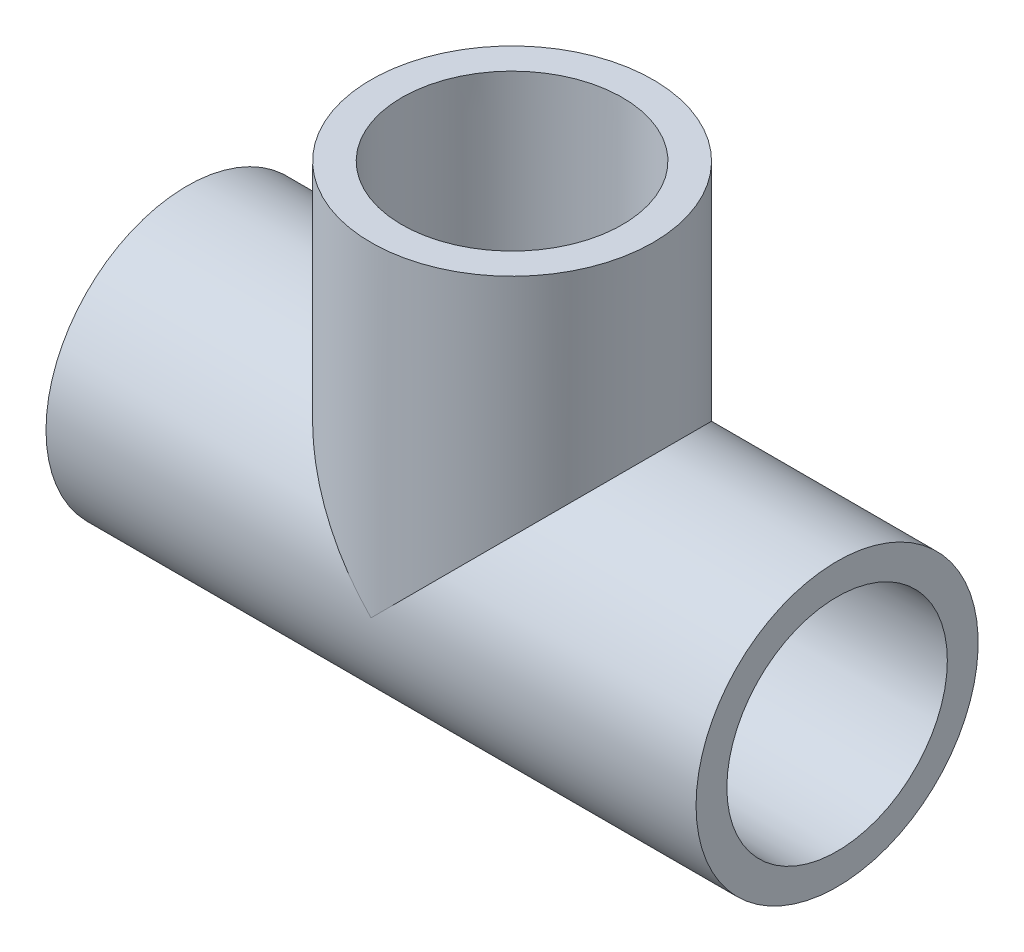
from build123d import *

# Parameters (mm, degrees)
BOSS_EXTRUDE1_START = 25.4
SKETCH4_R           = 13.7795
BOSS_EXTRUDE1_DEPTH = 25.4
SKETCH5_R           = 13.7795
BOSS_EXTRUDE2_DEPTH = 12.7


with BuildPart() as part:
    # Sketch1 → Revolve1 (revolve)
    with BuildSketch(Plane.XY, mode=Mode.PRIVATE) as revolve1_sk:
        Polygon((-31.75, -13.7795), (-12.7, -13.7795), (-12.7, -10.6172), (-31.75, -10.7696), align=None)
        Polygon((31.75, -10.7696), (12.7, -10.6172), (12.7, -13.7795), (31.75, -13.7795), align=None)
    revolve(revolve1_sk.sketch.rotate(Axis((-31.75, 0, 0), (1, 0, 0)), 270), axis=Axis((-31.75, 0, 0), (1, 0, 0)))



with BuildPart() as body_2:
    # Sketch2 → Revolve2 (revolve)
    with BuildSketch(Plane.XY):
        Polygon((10.7696, 31.75), (10.6172, 12.7), (13.7795, 12.7), (13.7795, 31.75), align=None)
    revolve(axis=Axis((0, 0, 0), (0, 1, 0)))


with BuildPart() as part_1:
    add(part.part)

    add(body_2.part)  # Boss-Extrude1 merges body 2
    # Sketch4 → Boss-Extrude1 (add)
    with BuildSketch(Plane(origin=(-12.7, 0, 0), x_dir=(0, 0, -1), z_dir=(1, 0, 0)).offset(BOSS_EXTRUDE1_START)):
        with Locations(Location((0, 0, 0), (0, 0, 180))):
            Circle(SKETCH4_R)
    extrude(amount=-BOSS_EXTRUDE1_DEPTH)

    # Sketch5 → Boss-Extrude2 (add)
    with BuildSketch(Plane.XZ.offset(-12.7)):
        Circle(SKETCH5_R)
    extrude(amount=BOSS_EXTRUDE2_DEPTH)

    # Sketch6 → Cut-Revolve1 (revolve, cut)
    with BuildSketch(Plane.XY, mode=Mode.PRIVATE) as cut_revolve1_sk:
        Polygon((-31.75, -10.7696), (-12.7, -10.6172), (-12.7, -7.8994), (12.7, -7.8994), (12.7, -10.6172), (31.75, -10.7696), (31.75, 0), (-31.75, 0), align=None)
    revolve(cut_revolve1_sk.sketch.rotate(Axis((31.75, 0, 0), (-1, 0, 0)), 270), axis=Axis((31.75, 0, 0), (-1, 0, 0)), mode=Mode.SUBTRACT)

    # Sketch7 → Cut-Revolve2 (revolve, cut)
    with BuildSketch(Plane.XY, mode=Mode.PRIVATE) as cut_revolve2_sk:
        Polygon((10.7696, 31.75), (10.6172, 12.7), (7.8994, 12.7), (7.8994, 0), (0, 0), (0, 31.75), align=None)
    revolve(cut_revolve2_sk.sketch.rotate(Axis((0, 0, 0), (0, 1, 0)), 180), axis=Axis((0, 0, 0), (0, 1, 0)), mode=Mode.SUBTRACT)


solid = part_1.part
